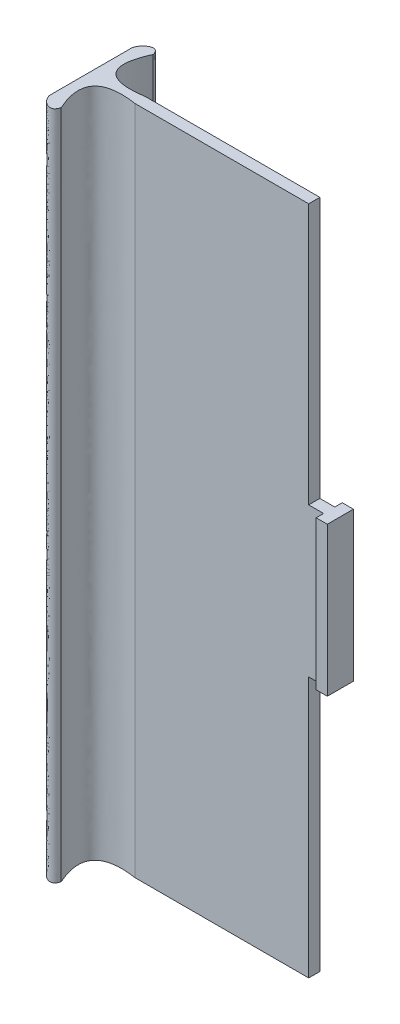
ISO-10303-21;
HEADER;
FILE_DESCRIPTION(('STEP AP214'),'2;1');
FILE_NAME('part.step','',(''),(''),'','','');
FILE_SCHEMA(('AUTOMOTIVE_DESIGN { 1 0 10303 214 1 1 1 1 }'));
ENDSEC;
DATA;
#1=APPLICATION_CONTEXT('core data for automotive mechanical design processes');
#2=APPLICATION_PROTOCOL_DEFINITION('international standard','automotive_design',2000,#1);
#3=PRODUCT_CONTEXT('',#1,'mechanical');
#4=PRODUCT('Part','Part','',(#3));
#5=PRODUCT_RELATED_PRODUCT_CATEGORY('part','',(#4));
#6=PRODUCT_DEFINITION_FORMATION('','',#4);
#7=PRODUCT_DEFINITION_CONTEXT('part definition',#1,'design');
#8=PRODUCT_DEFINITION('design','',#6,#7);
#9=PRODUCT_DEFINITION_SHAPE('','',#8);
#10=(LENGTH_UNIT() NAMED_UNIT(*) SI_UNIT(.MILLI.,.METRE.));
#11=(NAMED_UNIT(*) PLANE_ANGLE_UNIT() SI_UNIT($,.RADIAN.));
#12=(NAMED_UNIT(*) SI_UNIT($,.STERADIAN.) SOLID_ANGLE_UNIT());
#13=UNCERTAINTY_MEASURE_WITH_UNIT(LENGTH_MEASURE(1.E-05),#10,'distance_accuracy_value','');
#14=(GEOMETRIC_REPRESENTATION_CONTEXT(3) GLOBAL_UNCERTAINTY_ASSIGNED_CONTEXT((#13)) GLOBAL_UNIT_ASSIGNED_CONTEXT((#10,
#11,#12)) REPRESENTATION_CONTEXT('',''));
#15=CARTESIAN_POINT('',(0.,0.,0.));
#16=DIRECTION('',(0.,0.,1.));
#17=DIRECTION('',(1.,0.,0.));
#18=AXIS2_PLACEMENT_3D('',#15,#16,#17);
#19=CARTESIAN_POINT('',(0.,180.,0.));
#20=DIRECTION('',(-1.,0.,0.));
#21=DIRECTION('',(0.,0.,1.));
#22=AXIS2_PLACEMENT_3D('',#19,#20,#21);
#23=PLANE('',#22);
#24=DIRECTION('',(0.,0.,1.));
#25=VECTOR('',#24,1.);
#26=CARTESIAN_POINT('',(0.,110.,0.));
#27=LINE('',#26,#25);
#28=CARTESIAN_POINT('',(0.,110.,0.));
#29=VERTEX_POINT('',#28);
#30=CARTESIAN_POINT('',(0.,110.,3.));
#31=VERTEX_POINT('',#30);
#32=EDGE_CURVE('E149',#29,#31,#27,.T.);
#33=ORIENTED_EDGE('',*,*,#32,.F.);
#34=DIRECTION('',(0.,-1.,0.));
#35=VECTOR('',#34,1.);
#36=CARTESIAN_POINT('',(0.,180.,0.));
#37=LINE('',#36,#35);
#38=CARTESIAN_POINT('',(0.,180.,0.));
#39=VERTEX_POINT('',#38);
#40=EDGE_CURVE('E306',#39,#29,#37,.T.);
#41=ORIENTED_EDGE('',*,*,#40,.F.);
#42=DIRECTION('',(0.,0.,-1.));
#43=VECTOR('',#42,1.);
#44=CARTESIAN_POINT('',(0.,180.,0.));
#45=LINE('',#44,#43);
#46=CARTESIAN_POINT('',(0.,180.,3.));
#47=VERTEX_POINT('',#46);
#48=EDGE_CURVE('E151',#47,#39,#45,.T.);
#49=ORIENTED_EDGE('',*,*,#48,.F.);
#50=DIRECTION('',(0.,-1.,0.));
#51=VECTOR('',#50,1.);
#52=CARTESIAN_POINT('',(0.,180.,3.));
#53=LINE('',#52,#51);
#54=EDGE_CURVE('E145',#47,#31,#53,.T.);
#55=ORIENTED_EDGE('',*,*,#54,.T.);
#56=EDGE_LOOP('',(#33,#41,#49,#55));
#57=FACE_BOUND('',#56,.T.);
#58=ADVANCED_FACE('F33',(#57),#23,.F.);
#59=CARTESIAN_POINT('',(0.,180.,0.));
#60=DIRECTION('',(0.,0.,1.));
#61=DIRECTION('',(1.,0.,0.));
#62=AXIS2_PLACEMENT_3D('',#59,#60,#61);
#63=PLANE('',#62);
#64=DIRECTION('',(-1.,0.,0.));
#65=VECTOR('',#64,1.);
#66=CARTESIAN_POINT('',(0.,0.,0.));
#67=LINE('',#66,#65);
#68=CARTESIAN_POINT('',(0.,0.,0.));
#69=VERTEX_POINT('',#68);
#70=CARTESIAN_POINT('',(-46.6472567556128,0.,0.));
#71=VERTEX_POINT('',#70);
#72=EDGE_CURVE('E214',#69,#71,#67,.T.);
#73=ORIENTED_EDGE('',*,*,#72,.T.);
#74=DIRECTION('',(0.,-1.,0.));
#75=VECTOR('',#74,1.);
#76=CARTESIAN_POINT('',(-46.6472567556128,180.,0.));
#77=LINE('',#76,#75);
#78=CARTESIAN_POINT('',(-46.6472567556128,180.,0.));
#79=VERTEX_POINT('',#78);
#80=EDGE_CURVE('E11',#79,#71,#77,.T.);
#81=ORIENTED_EDGE('',*,*,#80,.F.);
#82=DIRECTION('',(-1.,0.,0.));
#83=VECTOR('',#82,1.);
#84=CARTESIAN_POINT('',(0.,180.,0.));
#85=LINE('',#84,#83);
#86=EDGE_CURVE('E215',#39,#79,#85,.T.);
#87=ORIENTED_EDGE('',*,*,#86,.F.);
#88=ORIENTED_EDGE('',*,*,#40,.T.);
#89=DIRECTION('',(-1.,0.,0.));
#90=VECTOR('',#89,1.);
#91=CARTESIAN_POINT('',(0.,110.,0.));
#92=LINE('',#91,#90);
#93=CARTESIAN_POINT('',(4.,110.,0.));
#94=VERTEX_POINT('',#93);
#95=EDGE_CURVE('E170',#94,#29,#92,.T.);
#96=ORIENTED_EDGE('',*,*,#95,.F.);
#97=DIRECTION('',(0.,-1.,0.));
#98=VECTOR('',#97,1.);
#99=CARTESIAN_POINT('',(4.,110.,0.));
#100=LINE('',#99,#98);
#101=CARTESIAN_POINT('',(4.,70.,0.));
#102=VERTEX_POINT('',#101);
#103=EDGE_CURVE('E186',#94,#102,#100,.T.);
#104=ORIENTED_EDGE('',*,*,#103,.T.);
#105=DIRECTION('',(-1.,0.,0.));
#106=VECTOR('',#105,1.);
#107=CARTESIAN_POINT('',(0.,70.,0.));
#108=LINE('',#107,#106);
#109=CARTESIAN_POINT('',(0.,70.,0.));
#110=VERTEX_POINT('',#109);
#111=EDGE_CURVE('E171',#102,#110,#108,.T.);
#112=ORIENTED_EDGE('',*,*,#111,.T.);
#113=EDGE_CURVE('E53',#110,#69,#37,.T.);
#114=ORIENTED_EDGE('',*,*,#113,.T.);
#115=EDGE_LOOP('',(#73,#81,#87,#88,#96,#104,#112,#114));
#116=FACE_BOUND('',#115,.T.);
#117=ADVANCED_FACE('F35',(#116),#63,.F.);
#118=CARTESIAN_POINT('',(-46.6472567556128,180.,0.));
#119=CARTESIAN_POINT('',(-61.4880932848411,180.,2.25567074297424));
#120=CARTESIAN_POINT('',(-55.5989461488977,180.,-10.8556273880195));
#121=B_SPLINE_CURVE_WITH_KNOTS('',2,(#118,#119,#120),.UNSPECIFIED.,.F.,.F.,(3,3),(0.,1.),.UNSPECIFIED.);
#122=DIRECTION('',(0.,-1.,0.));
#123=VECTOR('',#122,1.);
#124=SURFACE_OF_LINEAR_EXTRUSION('',#121,#123);
#125=CARTESIAN_POINT('',(-46.6472567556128,0.,0.));
#126=CARTESIAN_POINT('',(-61.4880932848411,0.,2.25567074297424));
#127=CARTESIAN_POINT('',(-55.5989461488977,0.,-10.8556273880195));
#128=B_SPLINE_CURVE_WITH_KNOTS('',2,(#125,#126,#127),.UNSPECIFIED.,.F.,.F.,(3,3),(0.,1.),.UNSPECIFIED.);
#129=CARTESIAN_POINT('',(-55.5989461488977,0.,-10.8556273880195));
#130=VERTEX_POINT('',#129);
#131=EDGE_CURVE('E273',#71,#130,#128,.T.);
#132=ORIENTED_EDGE('',*,*,#131,.T.);
#133=DIRECTION('',(0.,-1.,0.));
#134=VECTOR('',#133,1.);
#135=CARTESIAN_POINT('',(-55.5989461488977,180.,-10.8556273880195));
#136=LINE('',#135,#134);
#137=CARTESIAN_POINT('',(-55.5989461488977,180.,-10.8556273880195));
#138=VERTEX_POINT('',#137);
#139=EDGE_CURVE('E41',#138,#130,#136,.T.);
#140=ORIENTED_EDGE('',*,*,#139,.F.);
#141=EDGE_CURVE('E218',#79,#138,#121,.T.);
#142=ORIENTED_EDGE('',*,*,#141,.F.);
#143=ORIENTED_EDGE('',*,*,#80,.T.);
#144=EDGE_LOOP('',(#132,#140,#142,#143));
#145=FACE_BOUND('',#144,.T.);
#146=ADVANCED_FACE('F232',(#145),#124,.F.);
#147=CARTESIAN_POINT('',(-55.5989461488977,180.,-10.8556273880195));
#148=CARTESIAN_POINT('',(-56.3572585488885,180.,-14.2234653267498));
#149=CARTESIAN_POINT('',(-60.2311939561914,180.,-11.2167234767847));
#150=CARTESIAN_POINT('',(-60.,180.,-9.04299588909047));
#151=B_SPLINE_CURVE_WITH_KNOTS('',3,(#147,#148,#149,#150),.UNSPECIFIED.,.F.,.F.,(4,4),(0.,1.),.UNSPECIFIED.);
#152=DIRECTION('',(0.,-1.,0.));
#153=VECTOR('',#152,1.);
#154=SURFACE_OF_LINEAR_EXTRUSION('',#151,#153);
#155=CARTESIAN_POINT('',(-55.5989461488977,0.,-10.8556273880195));
#156=CARTESIAN_POINT('',(-56.3572585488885,0.,-14.2234653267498));
#157=CARTESIAN_POINT('',(-60.2311939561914,0.,-11.2167234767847));
#158=CARTESIAN_POINT('',(-60.,0.,-9.04299588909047));
#159=B_SPLINE_CURVE_WITH_KNOTS('',3,(#155,#156,#157,#158),.UNSPECIFIED.,.F.,.F.,(4,4),(0.,1.),.UNSPECIFIED.);
#160=CARTESIAN_POINT('',(-60.,0.,-9.04299588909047));
#161=VERTEX_POINT('',#160);
#162=EDGE_CURVE('E277',#130,#161,#159,.T.);
#163=ORIENTED_EDGE('',*,*,#162,.T.);
#164=DIRECTION('',(0.,-1.,0.));
#165=VECTOR('',#164,1.);
#166=CARTESIAN_POINT('',(-60.,180.,-9.04299588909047));
#167=LINE('',#166,#165);
#168=CARTESIAN_POINT('',(-60.,180.,-9.04299588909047));
#169=VERTEX_POINT('',#168);
#170=EDGE_CURVE('E316',#169,#161,#167,.T.);
#171=ORIENTED_EDGE('',*,*,#170,.F.);
#172=EDGE_CURVE('E224',#138,#169,#151,.T.);
#173=ORIENTED_EDGE('',*,*,#172,.F.);
#174=ORIENTED_EDGE('',*,*,#139,.T.);
#175=EDGE_LOOP('',(#163,#171,#173,#174));
#176=FACE_BOUND('',#175,.T.);
#177=ADVANCED_FACE('F235',(#176),#154,.F.);
#178=CARTESIAN_POINT('',(-60.,180.,12.0429958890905));
#179=DIRECTION('',(1.,0.,0.));
#180=DIRECTION('',(0.,0.,-1.));
#181=AXIS2_PLACEMENT_3D('',#178,#179,#180);
#182=PLANE('',#181);
#183=DIRECTION('',(0.,0.,1.));
#184=VECTOR('',#183,1.);
#185=CARTESIAN_POINT('',(-60.,0.,12.0429958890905));
#186=LINE('',#185,#184);
#187=CARTESIAN_POINT('',(-60.,0.,12.0429958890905));
#188=VERTEX_POINT('',#187);
#189=EDGE_CURVE('E284',#161,#188,#186,.T.);
#190=ORIENTED_EDGE('',*,*,#189,.T.);
#191=DIRECTION('',(0.,-1.,0.));
#192=VECTOR('',#191,1.);
#193=CARTESIAN_POINT('',(-60.,180.,12.0429958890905));
#194=LINE('',#193,#192);
#195=CARTESIAN_POINT('',(-60.,180.,12.0429958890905));
#196=VERTEX_POINT('',#195);
#197=EDGE_CURVE('E313',#196,#188,#194,.T.);
#198=ORIENTED_EDGE('',*,*,#197,.F.);
#199=DIRECTION('',(0.,0.,1.));
#200=VECTOR('',#199,1.);
#201=CARTESIAN_POINT('',(-60.,180.,12.0429958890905));
#202=LINE('',#201,#200);
#203=EDGE_CURVE('E257',#169,#196,#202,.T.);
#204=ORIENTED_EDGE('',*,*,#203,.F.);
#205=ORIENTED_EDGE('',*,*,#170,.T.);
#206=EDGE_LOOP('',(#190,#198,#204,#205));
#207=FACE_BOUND('',#206,.T.);
#208=ADVANCED_FACE('F239',(#207),#182,.F.);
#209=CARTESIAN_POINT('',(-60.,180.,12.0429958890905));
#210=CARTESIAN_POINT('',(-60.2311939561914,180.,14.2167234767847));
#211=CARTESIAN_POINT('',(-56.3572585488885,180.,17.2234653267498));
#212=CARTESIAN_POINT('',(-55.5989461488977,180.,13.8556273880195));
#213=B_SPLINE_CURVE_WITH_KNOTS('',3,(#209,#210,#211,#212),.UNSPECIFIED.,.F.,.F.,(4,4),(0.,1.),.UNSPECIFIED.);
#214=DIRECTION('',(0.,-1.,0.));
#215=VECTOR('',#214,1.);
#216=SURFACE_OF_LINEAR_EXTRUSION('',#213,#215);
#217=CARTESIAN_POINT('',(-60.,0.,12.0429958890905));
#218=CARTESIAN_POINT('',(-60.2311939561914,0.,14.2167234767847));
#219=CARTESIAN_POINT('',(-56.3572585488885,0.,17.2234653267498));
#220=CARTESIAN_POINT('',(-55.5989461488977,0.,13.8556273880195));
#221=B_SPLINE_CURVE_WITH_KNOTS('',3,(#217,#218,#219,#220),.UNSPECIFIED.,.F.,.F.,(4,4),(0.,1.),.UNSPECIFIED.);
#222=CARTESIAN_POINT('',(-55.5989461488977,0.,13.8556273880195));
#223=VERTEX_POINT('',#222);
#224=EDGE_CURVE('E289',#188,#223,#221,.T.);
#225=ORIENTED_EDGE('',*,*,#224,.T.);
#226=DIRECTION('',(0.,-1.,0.));
#227=VECTOR('',#226,1.);
#228=CARTESIAN_POINT('',(-55.5989461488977,180.,13.8556273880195));
#229=LINE('',#228,#227);
#230=CARTESIAN_POINT('',(-55.5989461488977,180.,13.8556273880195));
#231=VERTEX_POINT('',#230);
#232=EDGE_CURVE('E310',#231,#223,#229,.T.);
#233=ORIENTED_EDGE('',*,*,#232,.F.);
#234=EDGE_CURVE('E252',#196,#231,#213,.T.);
#235=ORIENTED_EDGE('',*,*,#234,.F.);
#236=ORIENTED_EDGE('',*,*,#197,.T.);
#237=EDGE_LOOP('',(#225,#233,#235,#236));
#238=FACE_BOUND('',#237,.T.);
#239=ADVANCED_FACE('F243',(#238),#216,.F.);
#240=CARTESIAN_POINT('',(-55.5989461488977,180.,13.8556273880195));
#241=CARTESIAN_POINT('',(-61.4880932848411,180.,0.744329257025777));
#242=CARTESIAN_POINT('',(-46.6472567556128,180.,3.00000000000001));
#243=B_SPLINE_CURVE_WITH_KNOTS('',2,(#240,#241,#242),.UNSPECIFIED.,.F.,.F.,(3,3),(0.,1.),.UNSPECIFIED.);
#244=DIRECTION('',(0.,-1.,0.));
#245=VECTOR('',#244,1.);
#246=SURFACE_OF_LINEAR_EXTRUSION('',#243,#245);
#247=CARTESIAN_POINT('',(-55.5989461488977,0.,13.8556273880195));
#248=CARTESIAN_POINT('',(-61.4880932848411,0.,0.744329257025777));
#249=CARTESIAN_POINT('',(-46.6472567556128,0.,3.00000000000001));
#250=B_SPLINE_CURVE_WITH_KNOTS('',2,(#247,#248,#249),.UNSPECIFIED.,.F.,.F.,(3,3),(0.,1.),.UNSPECIFIED.);
#251=CARTESIAN_POINT('',(-46.6472567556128,0.,3.));
#252=VERTEX_POINT('',#251);
#253=EDGE_CURVE('E293',#223,#252,#250,.T.);
#254=ORIENTED_EDGE('',*,*,#253,.T.);
#255=DIRECTION('',(0.,-1.,0.));
#256=VECTOR('',#255,1.);
#257=CARTESIAN_POINT('',(-46.6472567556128,180.,3.));
#258=LINE('',#257,#256);
#259=CARTESIAN_POINT('',(-46.6472567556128,180.,3.));
#260=VERTEX_POINT('',#259);
#261=EDGE_CURVE('E154',#260,#252,#258,.T.);
#262=ORIENTED_EDGE('',*,*,#261,.F.);
#263=EDGE_CURVE('E256',#231,#260,#243,.T.);
#264=ORIENTED_EDGE('',*,*,#263,.F.);
#265=ORIENTED_EDGE('',*,*,#232,.T.);
#266=EDGE_LOOP('',(#254,#262,#264,#265));
#267=FACE_BOUND('',#266,.T.);
#268=ADVANCED_FACE('F248',(#267),#246,.F.);
#269=CARTESIAN_POINT('',(0.,180.,3.));
#270=DIRECTION('',(0.,0.,-1.));
#271=DIRECTION('',(-1.,0.,0.));
#272=AXIS2_PLACEMENT_3D('',#269,#270,#271);
#273=PLANE('',#272);
#274=DIRECTION('',(1.,0.,0.));
#275=VECTOR('',#274,1.);
#276=CARTESIAN_POINT('',(0.,0.,3.));
#277=LINE('',#276,#275);
#278=CARTESIAN_POINT('',(0.,0.,3.));
#279=VERTEX_POINT('',#278);
#280=EDGE_CURVE('E300',#252,#279,#277,.T.);
#281=ORIENTED_EDGE('',*,*,#280,.T.);
#282=CARTESIAN_POINT('',(0.,70.,3.));
#283=VERTEX_POINT('',#282);
#284=EDGE_CURVE('E155',#283,#279,#53,.T.);
#285=ORIENTED_EDGE('',*,*,#284,.F.);
#286=DIRECTION('',(1.,0.,0.));
#287=VECTOR('',#286,1.);
#288=CARTESIAN_POINT('',(0.,70.,3.));
#289=LINE('',#288,#287);
#290=CARTESIAN_POINT('',(4.,70.,3.));
#291=VERTEX_POINT('',#290);
#292=EDGE_CURVE('E188',#283,#291,#289,.T.);
#293=ORIENTED_EDGE('',*,*,#292,.T.);
#294=DIRECTION('',(0.,-1.,0.));
#295=VECTOR('',#294,1.);
#296=CARTESIAN_POINT('',(4.,110.,3.));
#297=LINE('',#296,#295);
#298=CARTESIAN_POINT('',(4.,110.,3.));
#299=VERTEX_POINT('',#298);
#300=EDGE_CURVE('E162',#299,#291,#297,.T.);
#301=ORIENTED_EDGE('',*,*,#300,.F.);
#302=DIRECTION('',(1.,0.,0.));
#303=VECTOR('',#302,1.);
#304=CARTESIAN_POINT('',(0.,110.,3.));
#305=LINE('',#304,#303);
#306=EDGE_CURVE('E158',#31,#299,#305,.T.);
#307=ORIENTED_EDGE('',*,*,#306,.F.);
#308=ORIENTED_EDGE('',*,*,#54,.F.);
#309=DIRECTION('',(1.,0.,0.));
#310=VECTOR('',#309,1.);
#311=CARTESIAN_POINT('',(0.,180.,3.));
#312=LINE('',#311,#310);
#313=EDGE_CURVE('E265',#260,#47,#312,.T.);
#314=ORIENTED_EDGE('',*,*,#313,.F.);
#315=ORIENTED_EDGE('',*,*,#261,.T.);
#316=EDGE_LOOP('',(#281,#285,#293,#301,#307,#308,#314,#315));
#317=FACE_BOUND('',#316,.T.);
#318=ADVANCED_FACE('F160',(#317),#273,.F.);
#319=ORIENTED_EDGE('',*,*,#113,.F.);
#320=DIRECTION('',(0.,0.,1.));
#321=VECTOR('',#320,1.);
#322=CARTESIAN_POINT('',(0.,70.,0.));
#323=LINE('',#322,#321);
#324=EDGE_CURVE('E48',#110,#283,#323,.T.);
#325=ORIENTED_EDGE('',*,*,#324,.T.);
#326=ORIENTED_EDGE('',*,*,#284,.T.);
#327=DIRECTION('',(0.,0.,-1.));
#328=VECTOR('',#327,1.);
#329=CARTESIAN_POINT('',(0.,0.,0.));
#330=LINE('',#329,#328);
#331=EDGE_CURVE('E219',#279,#69,#330,.T.);
#332=ORIENTED_EDGE('',*,*,#331,.T.);
#333=EDGE_LOOP('',(#319,#325,#326,#332));
#334=FACE_BOUND('',#333,.T.);
#335=ADVANCED_FACE('F342',(#334),#23,.F.);
#336=CARTESIAN_POINT('',(-56.3055973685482,180.,-1.58607147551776));
#337=DIRECTION('',(0.,1.,0.));
#338=DIRECTION('',(0.,0.,1.));
#339=AXIS2_PLACEMENT_3D('',#336,#337,#338);
#340=PLANE('',#339);
#341=ORIENTED_EDGE('',*,*,#86,.T.);
#342=ORIENTED_EDGE('',*,*,#141,.T.);
#343=ORIENTED_EDGE('',*,*,#172,.T.);
#344=ORIENTED_EDGE('',*,*,#203,.T.);
#345=ORIENTED_EDGE('',*,*,#234,.T.);
#346=ORIENTED_EDGE('',*,*,#263,.T.);
#347=ORIENTED_EDGE('',*,*,#313,.T.);
#348=ORIENTED_EDGE('',*,*,#48,.T.);
#349=EDGE_LOOP('',(#341,#342,#343,#344,#345,#346,#347,#348));
#350=FACE_BOUND('',#349,.T.);
#351=ADVANCED_FACE('F335',(#350),#340,.T.);
#352=CARTESIAN_POINT('',(-56.3055973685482,0.,-1.58607147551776));
#353=DIRECTION('',(0.,1.,0.));
#354=DIRECTION('',(0.,0.,1.));
#355=AXIS2_PLACEMENT_3D('',#352,#353,#354);
#356=PLANE('',#355);
#357=ORIENTED_EDGE('',*,*,#72,.F.);
#358=ORIENTED_EDGE('',*,*,#331,.F.);
#359=ORIENTED_EDGE('',*,*,#280,.F.);
#360=ORIENTED_EDGE('',*,*,#253,.F.);
#361=ORIENTED_EDGE('',*,*,#224,.F.);
#362=ORIENTED_EDGE('',*,*,#189,.F.);
#363=ORIENTED_EDGE('',*,*,#162,.F.);
#364=ORIENTED_EDGE('',*,*,#131,.F.);
#365=EDGE_LOOP('',(#357,#358,#359,#360,#361,#362,#363,#364));
#366=FACE_BOUND('',#365,.T.);
#367=ADVANCED_FACE('F326',(#366),#356,.F.);
#368=CARTESIAN_POINT('',(4.,110.,3.));
#369=DIRECTION('',(1.,0.,0.));
#370=DIRECTION('',(0.,0.,-1.));
#371=AXIS2_PLACEMENT_3D('',#368,#369,#370);
#372=PLANE('',#371);
#373=DIRECTION('',(0.,0.,1.));
#374=VECTOR('',#373,1.);
#375=CARTESIAN_POINT('',(4.,70.,3.));
#376=LINE('',#375,#374);
#377=CARTESIAN_POINT('',(4.,70.,5.));
#378=VERTEX_POINT('',#377);
#379=EDGE_CURVE('E190',#291,#378,#376,.T.);
#380=ORIENTED_EDGE('',*,*,#379,.T.);
#381=DIRECTION('',(0.,-1.,0.));
#382=VECTOR('',#381,1.);
#383=CARTESIAN_POINT('',(4.,110.,5.));
#384=LINE('',#383,#382);
#385=CARTESIAN_POINT('',(4.,110.,5.));
#386=VERTEX_POINT('',#385);
#387=EDGE_CURVE('E210',#386,#378,#384,.T.);
#388=ORIENTED_EDGE('',*,*,#387,.F.);
#389=DIRECTION('',(0.,0.,1.));
#390=VECTOR('',#389,1.);
#391=CARTESIAN_POINT('',(4.,110.,3.));
#392=LINE('',#391,#390);
#393=EDGE_CURVE('E165',#299,#386,#392,.T.);
#394=ORIENTED_EDGE('',*,*,#393,.F.);
#395=ORIENTED_EDGE('',*,*,#300,.T.);
#396=EDGE_LOOP('',(#380,#388,#394,#395));
#397=FACE_BOUND('',#396,.T.);
#398=ADVANCED_FACE('F363',(#397),#372,.F.);
#399=CARTESIAN_POINT('',(4.,110.,5.));
#400=DIRECTION('',(0.,0.,-1.));
#401=DIRECTION('',(-1.,0.,0.));
#402=AXIS2_PLACEMENT_3D('',#399,#400,#401);
#403=PLANE('',#402);
#404=DIRECTION('',(1.,0.,0.));
#405=VECTOR('',#404,1.);
#406=CARTESIAN_POINT('',(4.,70.,5.));
#407=LINE('',#406,#405);
#408=CARTESIAN_POINT('',(7.,70.,5.));
#409=VERTEX_POINT('',#408);
#410=EDGE_CURVE('E192',#378,#409,#407,.T.);
#411=ORIENTED_EDGE('',*,*,#410,.T.);
#412=DIRECTION('',(0.,-1.,0.));
#413=VECTOR('',#412,1.);
#414=CARTESIAN_POINT('',(7.,110.,5.));
#415=LINE('',#414,#413);
#416=CARTESIAN_POINT('',(7.,110.,5.));
#417=VERTEX_POINT('',#416);
#418=EDGE_CURVE('E207',#417,#409,#415,.T.);
#419=ORIENTED_EDGE('',*,*,#418,.F.);
#420=DIRECTION('',(1.,0.,0.));
#421=VECTOR('',#420,1.);
#422=CARTESIAN_POINT('',(4.,110.,5.));
#423=LINE('',#422,#421);
#424=EDGE_CURVE('E177',#386,#417,#423,.T.);
#425=ORIENTED_EDGE('',*,*,#424,.F.);
#426=ORIENTED_EDGE('',*,*,#387,.T.);
#427=EDGE_LOOP('',(#411,#419,#425,#426));
#428=FACE_BOUND('',#427,.T.);
#429=ADVANCED_FACE('F367',(#428),#403,.F.);
#430=CARTESIAN_POINT('',(7.,110.,-2.));
#431=DIRECTION('',(-1.,0.,0.));
#432=DIRECTION('',(0.,0.,1.));
#433=AXIS2_PLACEMENT_3D('',#430,#431,#432);
#434=PLANE('',#433);
#435=DIRECTION('',(0.,0.,-1.));
#436=VECTOR('',#435,1.);
#437=CARTESIAN_POINT('',(7.,70.,-2.));
#438=LINE('',#437,#436);
#439=CARTESIAN_POINT('',(7.,70.,-2.));
#440=VERTEX_POINT('',#439);
#441=EDGE_CURVE('E194',#409,#440,#438,.T.);
#442=ORIENTED_EDGE('',*,*,#441,.T.);
#443=DIRECTION('',(0.,-1.,0.));
#444=VECTOR('',#443,1.);
#445=CARTESIAN_POINT('',(7.,110.,-2.));
#446=LINE('',#445,#444);
#447=CARTESIAN_POINT('',(7.,110.,-2.));
#448=VERTEX_POINT('',#447);
#449=EDGE_CURVE('E204',#448,#440,#446,.T.);
#450=ORIENTED_EDGE('',*,*,#449,.F.);
#451=DIRECTION('',(0.,0.,-1.));
#452=VECTOR('',#451,1.);
#453=CARTESIAN_POINT('',(7.,110.,-2.));
#454=LINE('',#453,#452);
#455=EDGE_CURVE('E179',#417,#448,#454,.T.);
#456=ORIENTED_EDGE('',*,*,#455,.F.);
#457=ORIENTED_EDGE('',*,*,#418,.T.);
#458=EDGE_LOOP('',(#442,#450,#456,#457));
#459=FACE_BOUND('',#458,.T.);
#460=ADVANCED_FACE('F371',(#459),#434,.F.);
#461=CARTESIAN_POINT('',(4.,110.,-2.));
#462=DIRECTION('',(0.,0.,1.));
#463=DIRECTION('',(1.,0.,0.));
#464=AXIS2_PLACEMENT_3D('',#461,#462,#463);
#465=PLANE('',#464);
#466=DIRECTION('',(-1.,0.,0.));
#467=VECTOR('',#466,1.);
#468=CARTESIAN_POINT('',(4.,70.,-2.));
#469=LINE('',#468,#467);
#470=CARTESIAN_POINT('',(4.,70.,-2.));
#471=VERTEX_POINT('',#470);
#472=EDGE_CURVE('E196',#440,#471,#469,.T.);
#473=ORIENTED_EDGE('',*,*,#472,.T.);
#474=DIRECTION('',(0.,-1.,0.));
#475=VECTOR('',#474,1.);
#476=CARTESIAN_POINT('',(4.,110.,-2.));
#477=LINE('',#476,#475);
#478=CARTESIAN_POINT('',(4.,110.,-2.));
#479=VERTEX_POINT('',#478);
#480=EDGE_CURVE('E201',#479,#471,#477,.T.);
#481=ORIENTED_EDGE('',*,*,#480,.F.);
#482=DIRECTION('',(-1.,0.,0.));
#483=VECTOR('',#482,1.);
#484=CARTESIAN_POINT('',(4.,110.,-2.));
#485=LINE('',#484,#483);
#486=EDGE_CURVE('E181',#448,#479,#485,.T.);
#487=ORIENTED_EDGE('',*,*,#486,.F.);
#488=ORIENTED_EDGE('',*,*,#449,.T.);
#489=EDGE_LOOP('',(#473,#481,#487,#488));
#490=FACE_BOUND('',#489,.T.);
#491=ADVANCED_FACE('F375',(#490),#465,.F.);
#492=CARTESIAN_POINT('',(4.,110.,-2.));
#493=DIRECTION('',(1.,0.,0.));
#494=DIRECTION('',(0.,0.,-1.));
#495=AXIS2_PLACEMENT_3D('',#492,#493,#494);
#496=PLANE('',#495);
#497=DIRECTION('',(0.,0.,1.));
#498=VECTOR('',#497,1.);
#499=CARTESIAN_POINT('',(4.,70.,-2.));
#500=LINE('',#499,#498);
#501=EDGE_CURVE('E173',#471,#102,#500,.T.);
#502=ORIENTED_EDGE('',*,*,#501,.T.);
#503=ORIENTED_EDGE('',*,*,#103,.F.);
#504=DIRECTION('',(0.,0.,1.));
#505=VECTOR('',#504,1.);
#506=CARTESIAN_POINT('',(4.,110.,-2.));
#507=LINE('',#506,#505);
#508=EDGE_CURVE('E183',#479,#94,#507,.T.);
#509=ORIENTED_EDGE('',*,*,#508,.F.);
#510=ORIENTED_EDGE('',*,*,#480,.T.);
#511=EDGE_LOOP('',(#502,#503,#509,#510));
#512=FACE_BOUND('',#511,.T.);
#513=ADVANCED_FACE('F379',(#512),#496,.F.);
#514=CARTESIAN_POINT('',(0.,110.,0.));
#515=DIRECTION('',(0.,1.,0.));
#516=DIRECTION('',(0.,0.,1.));
#517=AXIS2_PLACEMENT_3D('',#514,#515,#516);
#518=PLANE('',#517);
#519=ORIENTED_EDGE('',*,*,#32,.T.);
#520=ORIENTED_EDGE('',*,*,#306,.T.);
#521=ORIENTED_EDGE('',*,*,#393,.T.);
#522=ORIENTED_EDGE('',*,*,#424,.T.);
#523=ORIENTED_EDGE('',*,*,#455,.T.);
#524=ORIENTED_EDGE('',*,*,#486,.T.);
#525=ORIENTED_EDGE('',*,*,#508,.T.);
#526=ORIENTED_EDGE('',*,*,#95,.T.);
#527=EDGE_LOOP('',(#519,#520,#521,#522,#523,#524,#525,#526));
#528=FACE_BOUND('',#527,.T.);
#529=ADVANCED_FACE('F168',(#528),#518,.T.);
#530=CARTESIAN_POINT('',(0.,70.,0.));
#531=DIRECTION('',(0.,1.,0.));
#532=DIRECTION('',(0.,0.,1.));
#533=AXIS2_PLACEMENT_3D('',#530,#531,#532);
#534=PLANE('',#533);
#535=ORIENTED_EDGE('',*,*,#324,.F.);
#536=ORIENTED_EDGE('',*,*,#111,.F.);
#537=ORIENTED_EDGE('',*,*,#501,.F.);
#538=ORIENTED_EDGE('',*,*,#472,.F.);
#539=ORIENTED_EDGE('',*,*,#441,.F.);
#540=ORIENTED_EDGE('',*,*,#410,.F.);
#541=ORIENTED_EDGE('',*,*,#379,.F.);
#542=ORIENTED_EDGE('',*,*,#292,.F.);
#543=EDGE_LOOP('',(#535,#536,#537,#538,#539,#540,#541,#542));
#544=FACE_BOUND('',#543,.T.);
#545=ADVANCED_FACE('F384',(#544),#534,.F.);
#546=CLOSED_SHELL('',(#58,#117,#146,#177,#208,#239,#268,#318,#335,#351,#367,#398,#429,#460,#491,
#513,#529,#545));
#547=MANIFOLD_SOLID_BREP('B2',#546);
#548=ADVANCED_BREP_SHAPE_REPRESENTATION('',(#18,#547),#14);
#549=SHAPE_DEFINITION_REPRESENTATION(#9,#548);
ENDSEC;
END-ISO-10303-21;
